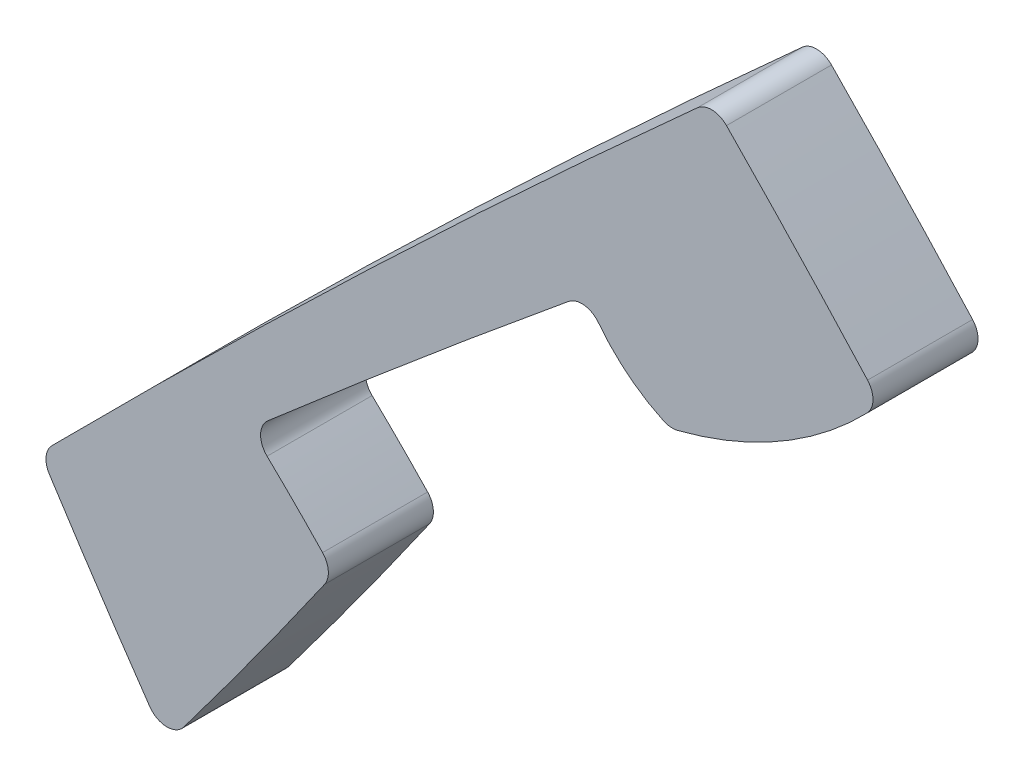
from build123d import *

# Parameters (mm, degrees)
LINEAR_AUSTRAGEN1_DEPTH = 1
VERRUNDUNG1_R           = 0.2


with BuildPart() as part:
    # Skizze1 → Linear austragen1 (new body)
    with BuildSketch(Plane.XY):
        with BuildLine():
            ThreePointArc((0, 1.8), (3.153553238, 4.898731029), (6.4, 7.9))
            ThreePointArc((6.4, 7.9), (7.209585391, 7.059021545), (8, 6.2))
            ThreePointArc((8, 6.2), (7.093693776, 5.443843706), (6, 5))
            ThreePointArc((6, 5), (5.542935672, 5.284783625), (5.2, 5.7))
            ThreePointArc((5.2, 5.7), (3.589296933, 4.362685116), (2, 3))
            ThreePointArc((2, 3), (2.407312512, 2.607312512), (2.8, 2.2))
            ThreePointArc((2.8, 2.2), (2.012615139, 1.090825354), (1.2, 0))
            ThreePointArc((1.2, 0), (0.590101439, 0.89340096), (0, 1.8))
        make_face()
    extrude(amount=LINEAR_AUSTRAGEN1_DEPTH)

    # Verrundung1
    verrundung1_edges = [part.edges().sort_by_distance(p)[0] for p in [
        (2.8, 2.2, 0.5),
        (1.2, 0, 0.5),
        (0, 1.8, 0.5),
        (6.4, 7.9, 0.5),
        (8, 6.2, 0.5),
        (6, 5, 0.5),
        (5.2, 5.7, 0.5),
        (2, 3, 0.5),
    ]]
    fillet(verrundung1_edges, radius=VERRUNDUNG1_R)


solid = part.part
